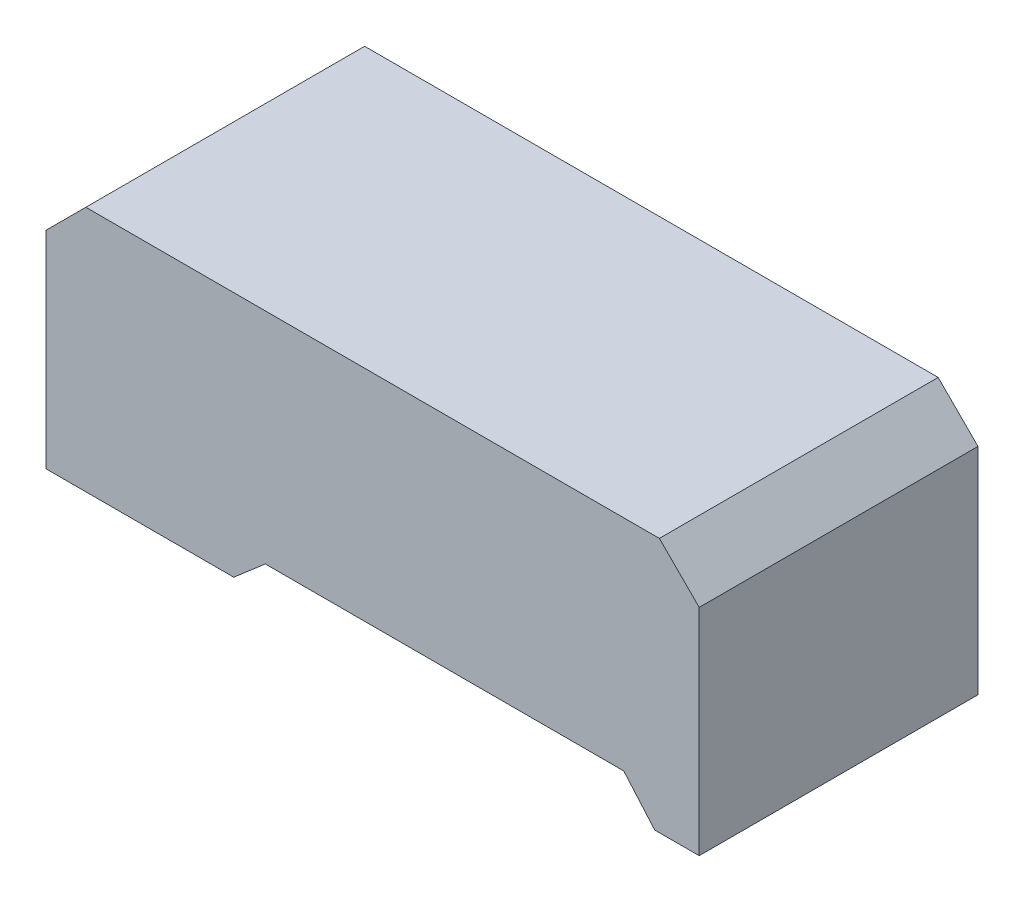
from build123d import *

# Parameters (mm, degrees)
EXTRUSION1_DEPTH = 35
CHANFREIN1_SIZE  = 5


with BuildPart() as part:
    # Esquisse1 → Extrusion1 (new body)
    with BuildSketch(Plane.XY):
        Polygon((-86.744520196, -19.137634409), (-63.17509895, -19.137634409), (-59.215647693, -15.718781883), (-14.215647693, -15.718781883), (-10.333227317, -20.201504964), (-4.744520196, -20.201504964), (-4.744520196, 11.798495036), (-86.744520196, 11.798495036), align=None)
    extrude(amount=EXTRUSION1_DEPTH)

    # Chanfrein1
    chanfrein1_edges = [part.edges().sort_by_distance(p)[0] for p in [
        (-86.744520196, 11.798495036, 17.5),
        (-4.744520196, 11.798495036, 17.5),
    ]]
    chamfer(chanfrein1_edges, length=CHANFREIN1_SIZE)


solid = part.part
